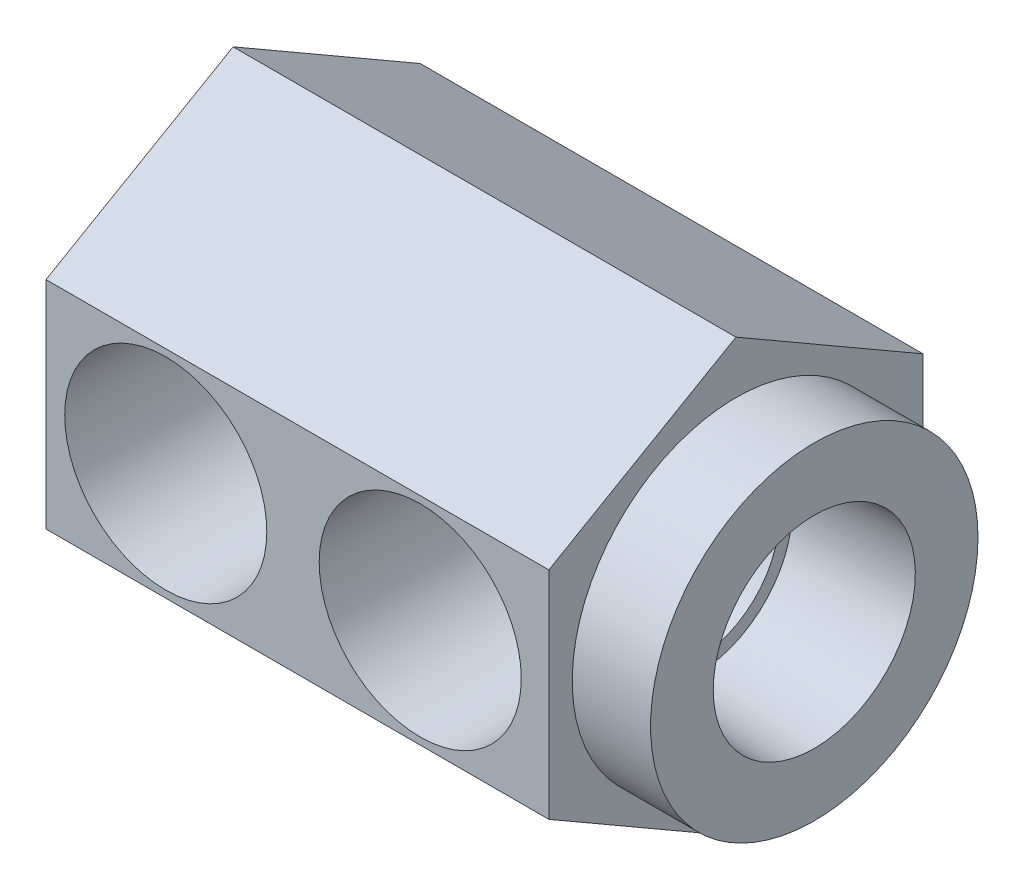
ISO-10303-21;
HEADER;
FILE_DESCRIPTION(('STEP AP214'),'2;1');
FILE_NAME('part.step','',(''),(''),'','','');
FILE_SCHEMA(('AUTOMOTIVE_DESIGN { 1 0 10303 214 1 1 1 1 }'));
ENDSEC;
DATA;
#1=APPLICATION_CONTEXT('core data for automotive mechanical design processes');
#2=APPLICATION_PROTOCOL_DEFINITION('international standard','automotive_design',2000,#1);
#3=PRODUCT_CONTEXT('',#1,'mechanical');
#4=PRODUCT('Part','Part','',(#3));
#5=PRODUCT_RELATED_PRODUCT_CATEGORY('part','',(#4));
#6=PRODUCT_DEFINITION_FORMATION('','',#4);
#7=PRODUCT_DEFINITION_CONTEXT('part definition',#1,'design');
#8=PRODUCT_DEFINITION('design','',#6,#7);
#9=PRODUCT_DEFINITION_SHAPE('','',#8);
#10=(LENGTH_UNIT() NAMED_UNIT(*) SI_UNIT(.MILLI.,.METRE.));
#11=(NAMED_UNIT(*) PLANE_ANGLE_UNIT() SI_UNIT($,.RADIAN.));
#12=(NAMED_UNIT(*) SI_UNIT($,.STERADIAN.) SOLID_ANGLE_UNIT());
#13=UNCERTAINTY_MEASURE_WITH_UNIT(LENGTH_MEASURE(1.E-05),#10,'distance_accuracy_value','');
#14=(GEOMETRIC_REPRESENTATION_CONTEXT(3) GLOBAL_UNCERTAINTY_ASSIGNED_CONTEXT((#13)) GLOBAL_UNIT_ASSIGNED_CONTEXT((#10,
#11,#12)) REPRESENTATION_CONTEXT('',''));
#15=CARTESIAN_POINT('',(0.,0.,0.));
#16=DIRECTION('',(0.,0.,1.));
#17=DIRECTION('',(1.,0.,0.));
#18=AXIS2_PLACEMENT_3D('',#15,#16,#17);
#19=CARTESIAN_POINT('',(30.9626,0.,2.6797));
#20=DIRECTION('',(0.,0.,-1.));
#21=DIRECTION('',(-1.,0.,0.));
#22=AXIS2_PLACEMENT_3D('',#19,#20,#21);
#23=PLANE('',#22);
#24=CARTESIAN_POINT('',(25.4,0.,2.6797));
#25=DIRECTION('',(0.,0.,1.));
#26=DIRECTION('',(1.,0.,0.));
#27=AXIS2_PLACEMENT_3D('',#24,#25,#26);
#28=CIRCLE('',#27,6.55797879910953);
#29=CARTESIAN_POINT('',(29.92247,4.74914213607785,2.6797));
#30=VERTEX_POINT('',#29);
#31=CARTESIAN_POINT('',(19.0669712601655,1.7028895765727,2.6797));
#32=VERTEX_POINT('',#31);
#33=EDGE_CURVE('E184',#30,#32,#28,.T.);
#34=ORIENTED_EDGE('',*,*,#33,.T.);
#35=DIRECTION('',(1.,0.,0.));
#36=VECTOR('',#35,1.);
#37=CARTESIAN_POINT('',(39.44747,1.7028895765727,2.6797));
#38=LINE('',#37,#36);
#39=CARTESIAN_POINT('',(20.1044654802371,1.7028895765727,2.6797));
#40=VERTEX_POINT('',#39);
#41=EDGE_CURVE('E64',#32,#40,#38,.T.);
#42=ORIENTED_EDGE('',*,*,#41,.T.);
#43=CARTESIAN_POINT('',(25.4,0.,2.6797));
#44=DIRECTION('',(0.,0.,1.));
#45=DIRECTION('',(1.,0.,0.));
#46=AXIS2_PLACEMENT_3D('',#43,#44,#45);
#47=CIRCLE('',#46,5.56260000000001);
#48=CARTESIAN_POINT('',(29.92247,3.23879358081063,2.6797));
#49=VERTEX_POINT('',#48);
#50=EDGE_CURVE('E192',#49,#40,#47,.T.);
#51=ORIENTED_EDGE('',*,*,#50,.F.);
#52=DIRECTION('',(0.,1.,0.));
#53=VECTOR('',#52,1.);
#54=CARTESIAN_POINT('',(29.92247,0.,2.6797));
#55=LINE('',#54,#53);
#56=EDGE_CURVE('E332',#49,#30,#55,.T.);
#57=ORIENTED_EDGE('',*,*,#56,.T.);
#58=EDGE_LOOP('',(#34,#42,#51,#57));
#59=FACE_BOUND('',#58,.T.);
#60=ADVANCED_FACE('F35',(#59),#23,.F.);
#61=CARTESIAN_POINT('',(39.44747,0.,0.));
#62=DIRECTION('',(1.,0.,0.));
#63=DIRECTION('',(0.,0.,-1.));
#64=AXIS2_PLACEMENT_3D('',#61,#62,#63);
#65=PLANE('',#64);
#66=CARTESIAN_POINT('',(39.44747,0.,0.));
#67=DIRECTION('',(1.,0.,0.));
#68=DIRECTION('',(0.,0.,-1.));
#69=AXIS2_PLACEMENT_3D('',#66,#67,#68);
#70=CIRCLE('',#69,11.1125);
#71=CARTESIAN_POINT('',(39.44747,0.,-11.1125));
#72=VERTEX_POINT('',#71);
#73=EDGE_CURVE('E283',#72,#72,#70,.T.);
#74=ORIENTED_EDGE('',*,*,#73,.T.);
#75=EDGE_LOOP('',(#74));
#76=FACE_BOUND('',#75,.T.);
#77=CARTESIAN_POINT('',(39.44747,0.,0.));
#78=DIRECTION('',(-1.,0.,0.));
#79=DIRECTION('',(0.,0.,1.));
#80=AXIS2_PLACEMENT_3D('',#77,#78,#79);
#81=CIRCLE('',#80,6.85927);
#82=CARTESIAN_POINT('',(39.44747,0.,6.85927));
#83=VERTEX_POINT('',#82);
#84=EDGE_CURVE('E279',#83,#83,#81,.T.);
#85=ORIENTED_EDGE('',*,*,#84,.T.);
#86=EDGE_LOOP('',(#85));
#87=FACE_BOUND('',#86,.T.);
#88=ADVANCED_FACE('F490',(#76,#87),#65,.T.);
#89=CARTESIAN_POINT('',(34.13125,-7.33234841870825,12.7));
#90=DIRECTION('',(1.,0.,0.));
#91=DIRECTION('',(0.,0.,-1.));
#92=AXIS2_PLACEMENT_3D('',#89,#90,#91);
#93=PLANE('',#92);
#94=DIRECTION('',(0.,-1.,0.));
#95=VECTOR('',#94,1.);
#96=CARTESIAN_POINT('',(34.13125,7.33234841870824,12.7));
#97=LINE('',#96,#95);
#98=CARTESIAN_POINT('',(34.13125,7.33234841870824,12.7));
#99=VERTEX_POINT('',#98);
#100=CARTESIAN_POINT('',(34.13125,-7.33234841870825,12.7));
#101=VERTEX_POINT('',#100);
#102=EDGE_CURVE('E289',#99,#101,#97,.T.);
#103=ORIENTED_EDGE('',*,*,#102,.T.);
#104=DIRECTION('',(0.,-0.5,-0.866025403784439));
#105=VECTOR('',#104,1.);
#106=CARTESIAN_POINT('',(34.13125,-7.33234841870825,12.7));
#107=LINE('',#106,#105);
#108=CARTESIAN_POINT('',(34.13125,-14.6646968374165,0.));
#109=VERTEX_POINT('',#108);
#110=EDGE_CURVE('E292',#101,#109,#107,.T.);
#111=ORIENTED_EDGE('',*,*,#110,.T.);
#112=DIRECTION('',(0.,0.500000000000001,-0.866025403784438));
#113=VECTOR('',#112,1.);
#114=CARTESIAN_POINT('',(34.13125,-14.6646968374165,0.));
#115=LINE('',#114,#113);
#116=CARTESIAN_POINT('',(34.13125,-7.33234841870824,-12.7));
#117=VERTEX_POINT('',#116);
#118=EDGE_CURVE('E295',#109,#117,#115,.T.);
#119=ORIENTED_EDGE('',*,*,#118,.T.);
#120=DIRECTION('',(0.,1.,0.));
#121=VECTOR('',#120,1.);
#122=CARTESIAN_POINT('',(34.13125,-7.33234841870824,-12.7));
#123=LINE('',#122,#121);
#124=CARTESIAN_POINT('',(34.13125,7.33234841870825,-12.7));
#125=VERTEX_POINT('',#124);
#126=EDGE_CURVE('E297',#117,#125,#123,.T.);
#127=ORIENTED_EDGE('',*,*,#126,.T.);
#128=DIRECTION('',(0.,0.5,0.866025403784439));
#129=VECTOR('',#128,1.);
#130=CARTESIAN_POINT('',(34.13125,7.33234841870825,-12.7));
#131=LINE('',#130,#129);
#132=CARTESIAN_POINT('',(34.13125,14.6646968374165,0.));
#133=VERTEX_POINT('',#132);
#134=EDGE_CURVE('E299',#125,#133,#131,.T.);
#135=ORIENTED_EDGE('',*,*,#134,.T.);
#136=DIRECTION('',(0.,-0.5,0.866025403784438));
#137=VECTOR('',#136,1.);
#138=CARTESIAN_POINT('',(34.13125,14.6646968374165,0.));
#139=LINE('',#138,#137);
#140=EDGE_CURVE('E301',#133,#99,#139,.T.);
#141=ORIENTED_EDGE('',*,*,#140,.T.);
#142=EDGE_LOOP('',(#103,#111,#119,#127,#135,#141));
#143=FACE_BOUND('',#142,.T.);
#144=CARTESIAN_POINT('',(34.13125,0.,0.));
#145=DIRECTION('',(1.,0.,0.));
#146=DIRECTION('',(0.,0.,-1.));
#147=AXIS2_PLACEMENT_3D('',#144,#145,#146);
#148=CIRCLE('',#147,11.1125);
#149=CARTESIAN_POINT('',(34.13125,0.,-11.1125));
#150=VERTEX_POINT('',#149);
#151=EDGE_CURVE('E282',#150,#150,#148,.T.);
#152=ORIENTED_EDGE('',*,*,#151,.F.);
#153=EDGE_LOOP('',(#152));
#154=FACE_BOUND('',#153,.T.);
#155=ADVANCED_FACE('F449',(#143,#154),#93,.T.);
#156=CARTESIAN_POINT('',(34.13125,7.33234841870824,12.7));
#157=DIRECTION('',(0.,0.,-1.));
#158=DIRECTION('',(0.,1.,0.));
#159=AXIS2_PLACEMENT_3D('',#156,#157,#158);
#160=PLANE('',#159);
#161=CARTESIAN_POINT('',(8.128,0.,12.7));
#162=DIRECTION('',(0.,0.,1.));
#163=DIRECTION('',(1.,0.,0.));
#164=AXIS2_PLACEMENT_3D('',#161,#162,#163);
#165=CIRCLE('',#164,6.858);
#166=CARTESIAN_POINT('',(14.986,0.,12.7));
#167=VERTEX_POINT('',#166);
#168=EDGE_CURVE('E422',#167,#167,#165,.T.);
#169=ORIENTED_EDGE('',*,*,#168,.F.);
#170=EDGE_LOOP('',(#169));
#171=FACE_BOUND('',#170,.T.);
#172=CARTESIAN_POINT('',(25.4,0.,12.7));
#173=DIRECTION('',(0.,0.,1.));
#174=DIRECTION('',(1.,0.,0.));
#175=AXIS2_PLACEMENT_3D('',#172,#173,#174);
#176=CIRCLE('',#175,6.858);
#177=CARTESIAN_POINT('',(32.258,0.,12.7));
#178=VERTEX_POINT('',#177);
#179=EDGE_CURVE('E185',#178,#178,#176,.T.);
#180=ORIENTED_EDGE('',*,*,#179,.F.);
#181=EDGE_LOOP('',(#180));
#182=FACE_BOUND('',#181,.T.);
#183=DIRECTION('',(0.,-1.,0.));
#184=VECTOR('',#183,1.);
#185=CARTESIAN_POINT('',(0.,7.33234841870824,12.7));
#186=LINE('',#185,#184);
#187=CARTESIAN_POINT('',(0.,7.33234841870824,12.7));
#188=VERTEX_POINT('',#187);
#189=CARTESIAN_POINT('',(0.,-7.33234841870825,12.7));
#190=VERTEX_POINT('',#189);
#191=EDGE_CURVE('E286',#188,#190,#186,.T.);
#192=ORIENTED_EDGE('',*,*,#191,.T.);
#193=DIRECTION('',(-1.,0.,0.));
#194=VECTOR('',#193,1.);
#195=CARTESIAN_POINT('',(34.13125,-7.33234841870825,12.7));
#196=LINE('',#195,#194);
#197=EDGE_CURVE('E328',#101,#190,#196,.T.);
#198=ORIENTED_EDGE('',*,*,#197,.F.);
#199=ORIENTED_EDGE('',*,*,#102,.F.);
#200=DIRECTION('',(-1.,0.,0.));
#201=VECTOR('',#200,1.);
#202=CARTESIAN_POINT('',(34.13125,7.33234841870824,12.7));
#203=LINE('',#202,#201);
#204=EDGE_CURVE('E303',#99,#188,#203,.T.);
#205=ORIENTED_EDGE('',*,*,#204,.T.);
#206=EDGE_LOOP('',(#192,#198,#199,#205));
#207=FACE_BOUND('',#206,.T.);
#208=ADVANCED_FACE('F37',(#171,#182,#207),#160,.F.);
#209=CARTESIAN_POINT('',(34.13125,-7.33234841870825,12.7));
#210=DIRECTION('',(0.,0.866025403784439,-0.5));
#211=DIRECTION('',(0.,0.5,0.866025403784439));
#212=AXIS2_PLACEMENT_3D('',#209,#210,#211);
#213=PLANE('',#212);
#214=DIRECTION('',(0.,-0.5,-0.866025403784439));
#215=VECTOR('',#214,1.);
#216=CARTESIAN_POINT('',(0.,-7.33234841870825,12.7));
#217=LINE('',#216,#215);
#218=CARTESIAN_POINT('',(0.,-14.6646968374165,0.));
#219=VERTEX_POINT('',#218);
#220=EDGE_CURVE('E306',#190,#219,#217,.T.);
#221=ORIENTED_EDGE('',*,*,#220,.T.);
#222=DIRECTION('',(-1.,0.,0.));
#223=VECTOR('',#222,1.);
#224=CARTESIAN_POINT('',(34.13125,-14.6646968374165,0.));
#225=LINE('',#224,#223);
#226=EDGE_CURVE('E326',#109,#219,#225,.T.);
#227=ORIENTED_EDGE('',*,*,#226,.F.);
#228=ORIENTED_EDGE('',*,*,#110,.F.);
#229=ORIENTED_EDGE('',*,*,#197,.T.);
#230=EDGE_LOOP('',(#221,#227,#228,#229));
#231=FACE_BOUND('',#230,.T.);
#232=ADVANCED_FACE('F448',(#231),#213,.F.);
#233=CARTESIAN_POINT('',(34.13125,-14.6646968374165,0.));
#234=DIRECTION('',(0.,0.866025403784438,0.500000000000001));
#235=DIRECTION('',(0.,-0.500000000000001,0.866025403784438));
#236=AXIS2_PLACEMENT_3D('',#233,#234,#235);
#237=PLANE('',#236);
#238=DIRECTION('',(0.,0.500000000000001,-0.866025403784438));
#239=VECTOR('',#238,1.);
#240=CARTESIAN_POINT('',(0.,-14.6646968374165,0.));
#241=LINE('',#240,#239);
#242=CARTESIAN_POINT('',(0.,-7.33234841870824,-12.7));
#243=VERTEX_POINT('',#242);
#244=EDGE_CURVE('E308',#219,#243,#241,.T.);
#245=ORIENTED_EDGE('',*,*,#244,.T.);
#246=DIRECTION('',(-1.,0.,0.));
#247=VECTOR('',#246,1.);
#248=CARTESIAN_POINT('',(34.13125,-7.33234841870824,-12.7));
#249=LINE('',#248,#247);
#250=EDGE_CURVE('E323',#117,#243,#249,.T.);
#251=ORIENTED_EDGE('',*,*,#250,.F.);
#252=ORIENTED_EDGE('',*,*,#118,.F.);
#253=ORIENTED_EDGE('',*,*,#226,.T.);
#254=EDGE_LOOP('',(#245,#251,#252,#253));
#255=FACE_BOUND('',#254,.T.);
#256=ADVANCED_FACE('F464',(#255),#237,.F.);
#257=CARTESIAN_POINT('',(34.13125,-7.33234841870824,-12.7));
#258=DIRECTION('',(0.,0.,1.));
#259=DIRECTION('',(0.,-1.,0.));
#260=AXIS2_PLACEMENT_3D('',#257,#258,#259);
#261=PLANE('',#260);
#262=CARTESIAN_POINT('',(8.128,0.,-12.7));
#263=DIRECTION('',(0.,0.,-1.));
#264=DIRECTION('',(0.,1.,0.));
#265=AXIS2_PLACEMENT_3D('',#262,#263,#264);
#266=CIRCLE('',#265,6.858);
#267=CARTESIAN_POINT('',(8.128,6.858,-12.7));
#268=VERTEX_POINT('',#267);
#269=EDGE_CURVE('E261',#268,#268,#266,.T.);
#270=ORIENTED_EDGE('',*,*,#269,.F.);
#271=EDGE_LOOP('',(#270));
#272=FACE_BOUND('',#271,.T.);
#273=DIRECTION('',(0.,1.,0.));
#274=VECTOR('',#273,1.);
#275=CARTESIAN_POINT('',(0.,-7.33234841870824,-12.7));
#276=LINE('',#275,#274);
#277=CARTESIAN_POINT('',(0.,7.33234841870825,-12.7));
#278=VERTEX_POINT('',#277);
#279=EDGE_CURVE('E310',#243,#278,#276,.T.);
#280=ORIENTED_EDGE('',*,*,#279,.T.);
#281=DIRECTION('',(-1.,0.,0.));
#282=VECTOR('',#281,1.);
#283=CARTESIAN_POINT('',(34.13125,7.33234841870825,-12.7));
#284=LINE('',#283,#282);
#285=EDGE_CURVE('E320',#125,#278,#284,.T.);
#286=ORIENTED_EDGE('',*,*,#285,.F.);
#287=ORIENTED_EDGE('',*,*,#126,.F.);
#288=ORIENTED_EDGE('',*,*,#250,.T.);
#289=EDGE_LOOP('',(#280,#286,#287,#288));
#290=FACE_BOUND('',#289,.T.);
#291=ADVANCED_FACE('F478',(#272,#290),#261,.F.);
#292=CARTESIAN_POINT('',(34.13125,7.33234841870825,-12.7));
#293=DIRECTION('',(0.,-0.866025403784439,0.5));
#294=DIRECTION('',(0.,-0.5,-0.866025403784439));
#295=AXIS2_PLACEMENT_3D('',#292,#293,#294);
#296=PLANE('',#295);
#297=DIRECTION('',(0.,0.5,0.866025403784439));
#298=VECTOR('',#297,1.);
#299=CARTESIAN_POINT('',(0.,7.33234841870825,-12.7));
#300=LINE('',#299,#298);
#301=CARTESIAN_POINT('',(0.,14.6646968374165,0.));
#302=VERTEX_POINT('',#301);
#303=EDGE_CURVE('E312',#278,#302,#300,.T.);
#304=ORIENTED_EDGE('',*,*,#303,.T.);
#305=DIRECTION('',(-1.,0.,0.));
#306=VECTOR('',#305,1.);
#307=CARTESIAN_POINT('',(34.13125,14.6646968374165,0.));
#308=LINE('',#307,#306);
#309=EDGE_CURVE('E317',#133,#302,#308,.T.);
#310=ORIENTED_EDGE('',*,*,#309,.F.);
#311=ORIENTED_EDGE('',*,*,#134,.F.);
#312=ORIENTED_EDGE('',*,*,#285,.T.);
#313=EDGE_LOOP('',(#304,#310,#311,#312));
#314=FACE_BOUND('',#313,.T.);
#315=ADVANCED_FACE('F476',(#314),#296,.F.);
#316=CARTESIAN_POINT('',(34.13125,14.6646968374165,0.));
#317=DIRECTION('',(0.,-0.866025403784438,-0.5));
#318=DIRECTION('',(0.,0.5,-0.866025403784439));
#319=AXIS2_PLACEMENT_3D('',#316,#317,#318);
#320=PLANE('',#319);
#321=DIRECTION('',(0.,-0.5,0.866025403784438));
#322=VECTOR('',#321,1.);
#323=CARTESIAN_POINT('',(0.,14.6646968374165,0.));
#324=LINE('',#323,#322);
#325=EDGE_CURVE('E293',#302,#188,#324,.T.);
#326=ORIENTED_EDGE('',*,*,#325,.T.);
#327=ORIENTED_EDGE('',*,*,#204,.F.);
#328=ORIENTED_EDGE('',*,*,#140,.F.);
#329=ORIENTED_EDGE('',*,*,#309,.T.);
#330=EDGE_LOOP('',(#326,#327,#328,#329));
#331=FACE_BOUND('',#330,.T.);
#332=ADVANCED_FACE('F474',(#331),#320,.F.);
#333=CARTESIAN_POINT('',(0.,-7.33234841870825,12.7));
#334=DIRECTION('',(1.,0.,0.));
#335=DIRECTION('',(0.,0.,-1.));
#336=AXIS2_PLACEMENT_3D('',#333,#334,#335);
#337=PLANE('',#336);
#338=ORIENTED_EDGE('',*,*,#191,.F.);
#339=ORIENTED_EDGE('',*,*,#325,.F.);
#340=ORIENTED_EDGE('',*,*,#303,.F.);
#341=ORIENTED_EDGE('',*,*,#279,.F.);
#342=ORIENTED_EDGE('',*,*,#244,.F.);
#343=ORIENTED_EDGE('',*,*,#220,.F.);
#344=EDGE_LOOP('',(#338,#339,#340,#341,#342,#343));
#345=FACE_BOUND('',#344,.T.);
#346=ADVANCED_FACE('F457',(#345),#337,.F.);
#347=CARTESIAN_POINT('',(39.44747,0.,0.));
#348=DIRECTION('',(-1.,0.,0.));
#349=DIRECTION('',(0.,0.,1.));
#350=AXIS2_PLACEMENT_3D('',#347,#348,#349);
#351=CYLINDRICAL_SURFACE('',#350,11.1125);
#352=ORIENTED_EDGE('',*,*,#73,.F.);
#353=EDGE_LOOP('',(#352));
#354=FACE_BOUND('',#353,.T.);
#355=ORIENTED_EDGE('',*,*,#151,.T.);
#356=EDGE_LOOP('',(#355));
#357=FACE_BOUND('',#356,.T.);
#358=ADVANCED_FACE('F519',(#354,#357),#351,.T.);
#359=CARTESIAN_POINT('',(39.44747,0.,0.));
#360=DIRECTION('',(1.,0.,0.));
#361=DIRECTION('',(0.,0.,-1.));
#362=AXIS2_PLACEMENT_3D('',#359,#360,#361);
#363=CONICAL_SURFACE('',#362,6.85927,0.0523598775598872);
#364=CARTESIAN_POINT('',(31.434967,2.79651950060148,5.80040855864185));
#365=CARTESIAN_POINT('',(31.4885738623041,2.68491125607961,5.85734580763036));
#366=CARTESIAN_POINT('',(31.5395481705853,2.57051306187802,5.9113986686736));
#367=CARTESIAN_POINT('',(31.6356400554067,2.33643131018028,6.01316652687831));
#368=CARTESIAN_POINT('',(31.6807526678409,2.21674338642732,6.06087615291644));
#369=CARTESIAN_POINT('',(31.7646308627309,1.97200075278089,6.14949518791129));
#370=CARTESIAN_POINT('',(31.8033661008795,1.84692376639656,6.19037209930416));
#371=CARTESIAN_POINT('',(31.8736020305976,1.59255780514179,6.2644343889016));
#372=CARTESIAN_POINT('',(31.9051046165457,1.46326994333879,6.29762178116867));
#373=CARTESIAN_POINT('',(31.9604703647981,1.20051379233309,6.35591633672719));
#374=CARTESIAN_POINT('',(31.9842919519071,1.06702690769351,6.380979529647));
#375=CARTESIAN_POINT('',(32.0235910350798,0.797488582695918,6.42231247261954));
#376=CARTESIAN_POINT('',(32.0390691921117,0.661437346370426,6.43858291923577));
#377=CARTESIAN_POINT('',(32.0613239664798,0.388244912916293,6.46197333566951));
#378=CARTESIAN_POINT('',(32.0681260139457,0.25110809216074,6.46912004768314));
#379=CARTESIAN_POINT('',(32.0729626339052,-0.0234825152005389,6.47420197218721));
#380=CARTESIAN_POINT('',(32.0709980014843,-0.160936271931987,6.47213802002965));
#381=CARTESIAN_POINT('',(32.058806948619,-0.425053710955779,6.45932755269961));
#382=CARTESIAN_POINT('',(32.0491894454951,-0.551777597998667,6.44922096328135));
#383=CARTESIAN_POINT('',(32.0226279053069,-0.80364039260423,6.42129811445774));
#384=CARTESIAN_POINT('',(32.005681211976,-0.928778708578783,6.40347905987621));
#385=CARTESIAN_POINT('',(31.964723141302,-1.17682126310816,6.36038910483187));
#386=CARTESIAN_POINT('',(31.9406993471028,-1.29972116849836,6.33510510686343));
#387=CARTESIAN_POINT('',(31.8860008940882,-1.54235323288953,6.27749566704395));
#388=CARTESIAN_POINT('',(31.8553245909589,-1.66208460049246,6.24516848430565));
#389=CARTESIAN_POINT('',(31.7700806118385,-1.95951809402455,6.15525600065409));
#390=CARTESIAN_POINT('',(31.7114113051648,-2.13476678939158,6.09330594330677));
#391=CARTESIAN_POINT('',(31.6141871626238,-2.38938982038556,5.9904492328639));
#392=CARTESIAN_POINT('',(31.5803287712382,-2.47271111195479,5.95460001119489));
#393=CARTESIAN_POINT('',(31.5097463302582,-2.63664903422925,5.87978975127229));
#394=CARTESIAN_POINT('',(31.4730236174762,-2.71726690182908,5.84083016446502));
#395=CARTESIAN_POINT('',(31.434967,-2.79651950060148,5.80040855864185));
#396=B_SPLINE_CURVE_WITH_KNOTS('',3,(#364,#365,#366,#367,#368,#369,#370,#371,#372,#373,#374,
#375,#376,#377,#378,#379,#380,#381,#382,#383,#384,#385,#386,#387,#388,#389,#390,#391,#392,#393,
#394,#395),.UNSPECIFIED.,.F.,.F.,(4,2,2,2,2,2,2,2,2,2,2,2,2,2,2,4),(0.,0.408818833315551,
0.817981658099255,1.22903833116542,1.6399872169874,2.05312450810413,2.46622906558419,
2.87811998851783,3.28997355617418,3.6719864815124,4.05413797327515,4.43696398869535,
4.81988473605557,5.4031989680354,5.69355402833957,5.98377437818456),.UNSPECIFIED.);
#397=CARTESIAN_POINT('',(31.50997,2.63463996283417,5.88001456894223));
#398=VERTEX_POINT('',#397);
#399=CARTESIAN_POINT('',(31.50997,-2.63463996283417,5.88001456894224));
#400=VERTEX_POINT('',#399);
#401=EDGE_CURVE('E242',#398,#400,#396,.T.);
#402=ORIENTED_EDGE('',*,*,#401,.F.);
#403=CARTESIAN_POINT('',(31.50997,0.,0.));
#404=DIRECTION('',(-1.,0.,0.));
#405=DIRECTION('',(0.,0.,1.));
#406=AXIS2_PLACEMENT_3D('',#403,#404,#405);
#407=CIRCLE('',#406,6.4432832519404);
#408=EDGE_CURVE('E276',#398,#400,#407,.T.);
#409=ORIENTED_EDGE('',*,*,#408,.T.);
#410=EDGE_LOOP('',(#402,#409));
#411=FACE_BOUND('',#410,.T.);
#412=ORIENTED_EDGE('',*,*,#84,.F.);
#413=EDGE_LOOP('',(#412));
#414=FACE_BOUND('',#413,.T.);
#415=ADVANCED_FACE('F516',(#411,#414),#363,.F.);
#416=CARTESIAN_POINT('',(31.50997,0.,-5.55625));
#417=DIRECTION('',(1.,0.,0.));
#418=DIRECTION('',(0.,0.,-1.));
#419=AXIS2_PLACEMENT_3D('',#416,#417,#418);
#420=PLANE('',#419);
#421=CARTESIAN_POINT('',(31.50997,-3.40485172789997,17.2630170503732));
#422=CARTESIAN_POINT('',(31.50997,-3.33912103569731,16.1949703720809));
#423=CARTESIAN_POINT('',(31.50997,-3.27201398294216,15.127006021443));
#424=CARTESIAN_POINT('',(31.50997,-3.13431515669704,12.991328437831));
#425=CARTESIAN_POINT('',(31.50997,-3.06372346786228,11.923615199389));
#426=CARTESIAN_POINT('',(31.50997,-2.91834199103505,9.78879369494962));
#427=CARTESIAN_POINT('',(31.50997,-2.84355346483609,8.72168534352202));
#428=CARTESIAN_POINT('',(31.50997,-2.68864021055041,6.58782277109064));
#429=CARTESIAN_POINT('',(31.50997,-2.60851532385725,5.52106856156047));
#430=CARTESIAN_POINT('',(31.50997,-2.44128073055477,3.3876946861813));
#431=CARTESIAN_POINT('',(31.50997,-2.35416839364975,2.32107522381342));
#432=CARTESIAN_POINT('',(31.50997,-2.21624588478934,0.721810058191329));
#433=CARTESIAN_POINT('',(31.50997,-2.16906454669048,0.188851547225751));
#434=CARTESIAN_POINT('',(31.50997,-2.07174805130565,-0.87680396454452));
#435=CARTESIAN_POINT('',(31.50997,-2.02161285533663,-1.40950096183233));
#436=CARTESIAN_POINT('',(31.50997,-1.91766350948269,-2.47471868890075));
#437=CARTESIAN_POINT('',(31.50997,-1.863848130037,-3.00723929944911));
#438=CARTESIAN_POINT('',(31.50997,-1.75150147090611,-4.07176620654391));
#439=CARTESIAN_POINT('',(31.50997,-1.69297035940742,-4.60377252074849));
#440=CARTESIAN_POINT('',(31.50997,-1.569551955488,-5.66718749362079));
#441=CARTESIAN_POINT('',(31.50997,-1.50466316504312,-6.19859598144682));
#442=CARTESIAN_POINT('',(31.50997,-1.40040042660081,-6.99483769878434));
#443=CARTESIAN_POINT('',(31.50997,-1.36448891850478,-7.26012215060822));
#444=CARTESIAN_POINT('',(31.50997,-1.28967950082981,-7.79027968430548));
#445=CARTESIAN_POINT('',(31.50997,-1.25078146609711,-8.05515274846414));
#446=CARTESIAN_POINT('',(31.50997,-1.21005294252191,-8.31975375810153));
#447=B_SPLINE_CURVE_WITH_KNOTS('',3,(#421,#422,#423,#424,#425,#426,#427,#428,#429,#430,#431,
#432,#433,#434,#435,#436,#437,#438,#439,#440,#441,#442,#443,#444,#445,#446),.UNSPECIFIED.,.F.,
.F.,(4,2,2,2,2,2,2,2,2,2,2,2,4),(0.,3.21020479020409,6.42033163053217,9.62949845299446,
12.8387607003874,16.0492367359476,17.654358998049,19.2595022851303,20.8651845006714,
22.470809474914,24.0768136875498,24.8799111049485,25.6830421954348),.UNSPECIFIED.);
#448=CARTESIAN_POINT('',(31.50997,-2.56197927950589,4.93033226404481));
#449=VERTEX_POINT('',#448);
#450=EDGE_CURVE('E249',#400,#449,#447,.T.);
#451=ORIENTED_EDGE('',*,*,#450,.F.);
#452=ORIENTED_EDGE('',*,*,#408,.F.);
#453=CARTESIAN_POINT('',(31.50997,1.21005294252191,-8.31975375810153));
#454=CARTESIAN_POINT('',(31.50997,1.25078146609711,-8.05515274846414));
#455=CARTESIAN_POINT('',(31.50997,1.28967950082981,-7.79027968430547));
#456=CARTESIAN_POINT('',(31.50997,1.36448891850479,-7.26012215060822));
#457=CARTESIAN_POINT('',(31.50997,1.40040042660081,-6.99483769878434));
#458=CARTESIAN_POINT('',(31.50997,1.50466316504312,-6.19859598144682));
#459=CARTESIAN_POINT('',(31.50997,1.569551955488,-5.6671874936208));
#460=CARTESIAN_POINT('',(31.50997,1.69297035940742,-4.60377252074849));
#461=CARTESIAN_POINT('',(31.50997,1.75150147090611,-4.07176620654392));
#462=CARTESIAN_POINT('',(31.50997,1.863848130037,-3.00723929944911));
#463=CARTESIAN_POINT('',(31.50997,1.91766350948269,-2.47471868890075));
#464=CARTESIAN_POINT('',(31.50997,2.02161285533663,-1.40950096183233));
#465=CARTESIAN_POINT('',(31.50997,2.07174805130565,-0.87680396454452));
#466=CARTESIAN_POINT('',(31.50997,2.16906454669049,0.188851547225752));
#467=CARTESIAN_POINT('',(31.50997,2.21624588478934,0.721810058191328));
#468=CARTESIAN_POINT('',(31.50997,2.35416839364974,2.32107522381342));
#469=CARTESIAN_POINT('',(31.50997,2.44128073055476,3.3876946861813));
#470=CARTESIAN_POINT('',(31.50997,2.60851532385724,5.52106856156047));
#471=CARTESIAN_POINT('',(31.50997,2.6886402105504,6.58782277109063));
#472=CARTESIAN_POINT('',(31.50997,2.8435534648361,8.72168534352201));
#473=CARTESIAN_POINT('',(31.50997,2.91834199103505,9.78879369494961));
#474=CARTESIAN_POINT('',(31.50997,3.06372346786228,11.923615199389));
#475=CARTESIAN_POINT('',(31.50997,3.13431515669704,12.991328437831));
#476=CARTESIAN_POINT('',(31.50997,3.27201398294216,15.127006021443));
#477=CARTESIAN_POINT('',(31.50997,3.33912103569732,16.1949703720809));
#478=CARTESIAN_POINT('',(31.50997,3.40485172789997,17.2630170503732));
#479=B_SPLINE_CURVE_WITH_KNOTS('',3,(#453,#454,#455,#456,#457,#458,#459,#460,#461,#462,#463,
#464,#465,#466,#467,#468,#469,#470,#471,#472,#473,#474,#475,#476,#477,#478),.UNSPECIFIED.,.F.,
.F.,(4,2,2,2,2,2,2,2,2,2,2,2,4),(0.,0.80313109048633,1.606228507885,3.21223272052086,
4.81785769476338,6.42353991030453,8.02868319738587,9.63380545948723,12.8442814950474,
16.0535437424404,19.2627105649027,22.4728374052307,25.6830421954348),.UNSPECIFIED.);
#480=CARTESIAN_POINT('',(31.50997,2.5619792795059,4.93033226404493));
#481=VERTEX_POINT('',#480);
#482=EDGE_CURVE('E205',#481,#398,#479,.T.);
#483=ORIENTED_EDGE('',*,*,#482,.F.);
#484=CARTESIAN_POINT('',(31.50997,0.,0.));
#485=DIRECTION('',(-1.,0.,0.));
#486=DIRECTION('',(0.,0.,1.));
#487=AXIS2_PLACEMENT_3D('',#484,#485,#486);
#488=CIRCLE('',#487,5.55625);
#489=EDGE_CURVE('E273',#481,#449,#488,.T.);
#490=ORIENTED_EDGE('',*,*,#489,.T.);
#491=EDGE_LOOP('',(#451,#452,#483,#490));
#492=FACE_BOUND('',#491,.T.);
#493=ADVANCED_FACE('F514',(#492),#420,.T.);
#494=CARTESIAN_POINT('',(-12.2161702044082,0.,0.));
#495=DIRECTION('',(-1.,0.,0.));
#496=DIRECTION('',(0.,0.,1.));
#497=AXIS2_PLACEMENT_3D('',#494,#495,#496);
#498=CYLINDRICAL_SURFACE('',#497,5.55625);
#499=CARTESIAN_POINT('',(31.51017,-2.56152070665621,4.93057052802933));
#500=CARTESIAN_POINT('',(31.4436665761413,-2.71404523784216,4.85132005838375));
#501=CARTESIAN_POINT('',(31.3724271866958,-2.86113407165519,4.76593043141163));
#502=CARTESIAN_POINT('',(31.222298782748,-3.14398924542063,4.58426476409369));
#503=CARTESIAN_POINT('',(31.1434194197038,-3.27976947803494,4.48800243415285));
#504=CARTESIAN_POINT('',(30.9812552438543,-3.53740196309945,4.28775051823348));
#505=CARTESIAN_POINT('',(30.8980863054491,-3.65947415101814,4.18394817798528));
#506=CARTESIAN_POINT('',(30.7275112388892,-3.89267876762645,3.96790084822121));
#507=CARTESIAN_POINT('',(30.6401046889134,-4.00381010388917,3.85565501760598));
#508=CARTESIAN_POINT('',(30.4490304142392,-4.23131634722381,3.60564002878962));
#509=CARTESIAN_POINT('',(30.3449139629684,-4.34591093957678,3.46658760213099));
#510=CARTESIAN_POINT('',(30.1873089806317,-4.50762737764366,3.24983980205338));
#511=CARTESIAN_POINT('',(30.1342276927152,-4.56010743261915,3.17578133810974));
#512=CARTESIAN_POINT('',(30.0281182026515,-4.66141056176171,3.02512683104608));
#513=CARTESIAN_POINT('',(29.9750900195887,-4.71023260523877,2.94853008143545));
#514=CARTESIAN_POINT('',(29.92227,-4.75722472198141,2.87066664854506));
#515=B_SPLINE_CURVE_WITH_KNOTS('',3,(#499,#500,#501,#502,#503,#504,#505,#506,#507,#508,#509,
#510,#511,#512,#513,#514),.UNSPECIFIED.,.F.,.F.,(4,2,2,2,2,2,2,4),(0.,0.552446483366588,
1.1042039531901,1.64520405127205,2.186258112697,2.80973715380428,3.1251069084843,
3.4405651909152),.UNSPECIFIED.);
#516=CARTESIAN_POINT('',(29.92247,-4.75704677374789,2.87096152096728));
#517=VERTEX_POINT('',#516);
#518=EDGE_CURVE('E255',#449,#517,#515,.T.);
#519=ORIENTED_EDGE('',*,*,#518,.F.);
#520=ORIENTED_EDGE('',*,*,#489,.F.);
#521=CARTESIAN_POINT('',(29.92227,4.75722472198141,2.87066664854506));
#522=CARTESIAN_POINT('',(29.9714207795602,4.71349676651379,2.94312370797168));
#523=CARTESIAN_POINT('',(30.0207539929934,4.6681825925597,3.01448372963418));
#524=CARTESIAN_POINT('',(30.1195036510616,4.57437090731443,3.15502687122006));
#525=CARTESIAN_POINT('',(30.1689200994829,4.52587324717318,3.22420988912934));
#526=CARTESIAN_POINT('',(30.3169890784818,4.37546886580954,3.42868072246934));
#527=CARTESIAN_POINT('',(30.415335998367,4.26876084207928,3.56070785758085));
#528=CARTESIAN_POINT('',(30.6068647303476,4.04510991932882,3.81270550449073));
#529=CARTESIAN_POINT('',(30.7001132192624,3.92845667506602,3.93288260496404));
#530=CARTESIAN_POINT('',(30.8819101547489,3.68290806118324,4.16370822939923));
#531=CARTESIAN_POINT('',(30.970462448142,3.55402296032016,4.27436459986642));
#532=CARTESIAN_POINT('',(31.1383585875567,3.2882843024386,4.48180571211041));
#533=CARTESIAN_POINT('',(31.2179073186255,3.15182183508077,4.57892274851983));
#534=CARTESIAN_POINT('',(31.3700495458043,2.86603911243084,4.76307965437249));
#535=CARTESIAN_POINT('',(31.4425556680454,2.71659253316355,4.84999518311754));
#536=CARTESIAN_POINT('',(31.51017,2.56152070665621,4.93057052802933));
#537=B_SPLINE_CURVE_WITH_KNOTS('',3,(#521,#522,#523,#524,#525,#526,#527,#528,#529,#530,#531,
#532,#533,#534,#535,#536),.UNSPECIFIED.,.F.,.F.,(4,2,2,2,2,2,2,4),(0.,0.293558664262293,
0.587131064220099,1.17501535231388,1.74946363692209,2.32343386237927,2.87889148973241,
3.44053822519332),.UNSPECIFIED.);
#538=CARTESIAN_POINT('',(29.92247,4.7570467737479,2.87096152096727));
#539=VERTEX_POINT('',#538);
#540=EDGE_CURVE('E198',#539,#481,#537,.T.);
#541=ORIENTED_EDGE('',*,*,#540,.F.);
#542=CARTESIAN_POINT('',(29.92247,0.,0.));
#543=DIRECTION('',(-1.,0.,0.));
#544=DIRECTION('',(0.,0.,1.));
#545=AXIS2_PLACEMENT_3D('',#542,#543,#544);
#546=CIRCLE('',#545,5.55625);
#547=EDGE_CURVE('E270',#539,#517,#546,.T.);
#548=ORIENTED_EDGE('',*,*,#547,.T.);
#549=EDGE_LOOP('',(#519,#520,#541,#548));
#550=FACE_BOUND('',#549,.T.);
#551=ADVANCED_FACE('F212',(#550),#498,.F.);
#552=CARTESIAN_POINT('',(29.92247,0.,-5.55625));
#553=DIRECTION('',(1.,0.,0.));
#554=DIRECTION('',(0.,0.,-1.));
#555=AXIS2_PLACEMENT_3D('',#552,#553,#554);
#556=PLANE('',#555);
#557=CARTESIAN_POINT('',(29.92247,-5.32151301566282,16.8962242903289));
#558=CARTESIAN_POINT('',(29.92247,-5.23763190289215,14.7617339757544));
#559=CARTESIAN_POINT('',(29.92247,-5.15294049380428,12.6272752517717));
#560=CARTESIAN_POINT('',(29.92247,-4.98162940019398,8.35843768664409));
#561=CARTESIAN_POINT('',(29.92247,-4.89500971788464,6.22405884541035));
#562=CARTESIAN_POINT('',(29.92247,-4.71953417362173,1.95539211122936));
#563=CARTESIAN_POINT('',(29.92247,-4.63067831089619,-0.178895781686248));
#564=CARTESIAN_POINT('',(29.92247,-4.45028389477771,-4.44736055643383));
#565=CARTESIAN_POINT('',(29.92247,-4.35874533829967,-6.58153743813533));
#566=CARTESIAN_POINT('',(29.92247,-4.26564226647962,-8.71564669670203));
#567=B_SPLINE_CURVE_WITH_KNOTS('',3,(#557,#558,#559,#560,#561,#562,#563,#564,#565,#566),
.UNSPECIFIED.,.F.,.F.,(4,2,2,2,4),(0.,6.40841377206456,12.8168201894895,19.2252288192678,
25.633644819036),.UNSPECIFIED.);
#568=CARTESIAN_POINT('',(29.92247,-4.74914213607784,2.6797));
#569=VERTEX_POINT('',#568);
#570=EDGE_CURVE('E49',#517,#569,#567,.T.);
#571=ORIENTED_EDGE('',*,*,#570,.F.);
#572=ORIENTED_EDGE('',*,*,#547,.F.);
#573=CARTESIAN_POINT('',(29.92247,4.26564226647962,-8.71564669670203));
#574=CARTESIAN_POINT('',(29.92247,4.35874533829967,-6.58153743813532));
#575=CARTESIAN_POINT('',(29.92247,4.45028389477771,-4.44736055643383));
#576=CARTESIAN_POINT('',(29.92247,4.63067831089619,-0.178895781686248));
#577=CARTESIAN_POINT('',(29.92247,4.71953417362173,1.95539211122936));
#578=CARTESIAN_POINT('',(29.92247,4.89500971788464,6.22405884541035));
#579=CARTESIAN_POINT('',(29.92247,4.98162940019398,8.35843768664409));
#580=CARTESIAN_POINT('',(29.92247,5.15294049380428,12.6272752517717));
#581=CARTESIAN_POINT('',(29.92247,5.23763190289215,14.7617339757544));
#582=CARTESIAN_POINT('',(29.92247,5.32151301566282,16.8962242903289));
#583=B_SPLINE_CURVE_WITH_KNOTS('',3,(#573,#574,#575,#576,#577,#578,#579,#580,#581,#582),
.UNSPECIFIED.,.F.,.F.,(4,2,2,2,4),(0.,6.40841599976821,12.8168246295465,19.2252310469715,
25.633644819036),.UNSPECIFIED.);
#584=EDGE_CURVE('E225',#30,#539,#583,.T.);
#585=ORIENTED_EDGE('',*,*,#584,.F.);
#586=ORIENTED_EDGE('',*,*,#56,.F.);
#587=DIRECTION('',(0.,0.,1.));
#588=VECTOR('',#587,1.);
#589=CARTESIAN_POINT('',(29.92247,3.23879358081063,12.7));
#590=LINE('',#589,#588);
#591=CARTESIAN_POINT('',(29.92247,3.23879358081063,-4.3688));
#592=VERTEX_POINT('',#591);
#593=EDGE_CURVE('E336',#592,#49,#590,.T.);
#594=ORIENTED_EDGE('',*,*,#593,.F.);
#595=CARTESIAN_POINT('',(29.92247,-8.71602218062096,-1.81102098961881));
#596=CARTESIAN_POINT('',(29.92247,-8.50084869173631,-1.92576274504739));
#597=CARTESIAN_POINT('',(29.92247,-8.28531316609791,-2.03983259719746));
#598=CARTESIAN_POINT('',(29.92247,-7.85332975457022,-2.26626874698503));
#599=CARTESIAN_POINT('',(29.92247,-7.6368818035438,-2.37863492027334));
#600=CARTESIAN_POINT('',(29.92247,-7.20233153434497,-2.60158729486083));
#601=CARTESIAN_POINT('',(29.92247,-6.98422632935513,-2.71216788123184));
#602=CARTESIAN_POINT('',(29.92247,-6.54671674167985,-2.93071889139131));
#603=CARTESIAN_POINT('',(29.92247,-6.32731239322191,-3.03868938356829));
#604=CARTESIAN_POINT('',(29.92247,-5.8740316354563,-3.25756931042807));
#605=CARTESIAN_POINT('',(29.92247,-5.640059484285,-3.36828115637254));
#606=CARTESIAN_POINT('',(29.92247,-5.16989173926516,-3.58494777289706));
#607=CARTESIAN_POINT('',(29.92247,-4.93369598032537,-3.69090218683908));
#608=CARTESIAN_POINT('',(29.92247,-4.45880739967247,-3.8964357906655));
#609=CARTESIAN_POINT('',(29.92247,-4.22011728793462,-3.99602120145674));
#610=CARTESIAN_POINT('',(29.92247,-3.73943760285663,-4.18682659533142));
#611=CARTESIAN_POINT('',(29.92247,-3.49744865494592,-4.27804813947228));
#612=CARTESIAN_POINT('',(29.92247,-3.01227435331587,-4.44829094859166));
#613=CARTESIAN_POINT('',(29.92247,-2.76913447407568,-4.5274400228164));
#614=CARTESIAN_POINT('',(29.92247,-2.2784983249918,-4.67110043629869));
#615=CARTESIAN_POINT('',(29.92247,-2.03100210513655,-4.73561194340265));
#616=CARTESIAN_POINT('',(29.92247,-1.53667040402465,-4.84443858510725));
#617=CARTESIAN_POINT('',(29.92247,-1.28992160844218,-4.88913355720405));
#618=CARTESIAN_POINT('',(29.92247,-0.917570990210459,-4.93936319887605));
#619=CARTESIAN_POINT('',(29.92247,-0.79307887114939,-4.95330445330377));
#620=CARTESIAN_POINT('',(29.92247,-0.543576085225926,-4.97521838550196));
#621=CARTESIAN_POINT('',(29.92247,-0.41856548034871,-4.98319175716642));
#622=CARTESIAN_POINT('',(29.92247,-0.150980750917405,-4.9936005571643));
#623=CARTESIAN_POINT('',(29.92247,-0.00836981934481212,-4.99511705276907));
#624=CARTESIAN_POINT('',(29.92247,0.276708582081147,-4.99003809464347));
#625=CARTESIAN_POINT('',(29.92247,0.419176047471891,-4.98344239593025));
#626=CARTESIAN_POINT('',(29.92247,0.703553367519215,-4.96239537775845));
#627=CARTESIAN_POINT('',(29.92247,0.845463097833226,-4.94794239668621));
#628=CARTESIAN_POINT('',(29.92247,1.12833632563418,-4.91170592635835));
#629=CARTESIAN_POINT('',(29.92247,1.26929980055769,-4.88992226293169));
#630=CARTESIAN_POINT('',(29.92247,1.55383583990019,-4.8390468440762));
#631=CARTESIAN_POINT('',(29.92247,1.69737556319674,-4.80977301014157));
#632=CARTESIAN_POINT('',(29.92247,1.98305368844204,-4.74507840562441));
#633=CARTESIAN_POINT('',(29.92247,2.12519205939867,-4.70965749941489));
#634=CARTESIAN_POINT('',(29.92247,2.40807269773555,-4.6335003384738));
#635=CARTESIAN_POINT('',(29.92247,2.54881454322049,-4.59276252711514));
#636=CARTESIAN_POINT('',(29.92247,2.82888831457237,-4.50675857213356));
#637=CARTESIAN_POINT('',(29.92247,2.96822032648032,-4.46149270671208));
#638=CARTESIAN_POINT('',(29.92247,3.37306261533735,-4.32376285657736));
#639=CARTESIAN_POINT('',(29.92247,3.63682545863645,-4.22616214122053));
#640=CARTESIAN_POINT('',(29.92247,4.160373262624,-4.02075846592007));
#641=CARTESIAN_POINT('',(29.92247,4.42015695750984,-3.91295233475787));
#642=CARTESIAN_POINT('',(29.92247,4.93675904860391,-3.68977396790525));
#643=CARTESIAN_POINT('',(29.92247,5.19357404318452,-3.57439390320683));
#644=CARTESIAN_POINT('',(29.92247,5.70459993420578,-3.33811181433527));
#645=CARTESIAN_POINT('',(29.92247,5.95881112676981,-3.21721042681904));
#646=CARTESIAN_POINT('',(29.92247,6.46616897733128,-2.97075227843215));
#647=CARTESIAN_POINT('',(29.92247,6.71930777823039,-2.8451793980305));
#648=CARTESIAN_POINT('',(29.92247,7.22395417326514,-2.59079190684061));
#649=CARTESIAN_POINT('',(29.92247,7.47546172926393,-2.46197722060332));
#650=CARTESIAN_POINT('',(29.92247,7.97701086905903,-2.20189412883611));
#651=CARTESIAN_POINT('',(29.92247,8.22705324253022,-2.07062724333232));
#652=CARTESIAN_POINT('',(29.92247,8.72607194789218,-1.80608098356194));
#653=CARTESIAN_POINT('',(29.92247,8.97504827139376,-1.67280159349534));
#654=CARTESIAN_POINT('',(29.92247,9.65356179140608,-1.30675129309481));
#655=CARTESIAN_POINT('',(29.92247,10.0822321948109,-1.07237446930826));
#656=CARTESIAN_POINT('',(29.92247,10.9377578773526,-0.600174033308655));
#657=CARTESIAN_POINT('',(29.92247,11.3646128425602,-0.362349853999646));
#658=CARTESIAN_POINT('',(29.92247,12.2136386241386,0.113955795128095));
#659=CARTESIAN_POINT('',(29.92247,12.6358202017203,0.352418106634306));
#660=CARTESIAN_POINT('',(29.92247,13.4790270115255,0.831189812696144));
#661=CARTESIAN_POINT('',(29.92247,13.9000524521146,1.07149884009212));
#662=CARTESIAN_POINT('',(29.92247,14.3206942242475,1.31247135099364));
#663=B_SPLINE_CURVE_WITH_KNOTS('',3,(#595,#596,#597,#598,#599,#600,#601,#602,#603,#604,#605,
#606,#607,#608,#609,#610,#611,#612,#613,#614,#615,#616,#617,#618,#619,#620,#621,#622,#623,#624,
#625,#626,#627,#628,#629,#630,#631,#632,#633,#634,#635,#636,#637,#638,#639,#640,#641,#642,#643,
#644,#645,#646,#647,#648,#649,#650,#651,#652,#653,#654,#655,#656,#657,#658,#659,#660,#661,#662),
.UNSPECIFIED.,.F.,.F.,(4,2,2,2,2,2,2,2,2,2,2,2,2,2,2,2,2,2,2,2,2,2,2,2,2,2,2,2,2,2,2,2,2,4),(0.,
0.731568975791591,1.4631910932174,2.19678547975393,2.93036062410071,3.70685103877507,
4.48339956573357,5.25917763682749,6.03481061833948,6.80155681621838,7.56829422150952,
8.31962222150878,8.69531020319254,9.0709544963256,9.49857607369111,9.92621056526,
10.353935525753,10.7816706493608,11.2209993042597,11.6603376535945,12.0998049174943,
12.5392451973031,13.3826355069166,14.2262887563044,15.070828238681,15.915270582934,
16.7629614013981,17.6106719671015,18.4578734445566,19.3050815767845,20.7707365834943,
22.2366354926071,23.6912481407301,25.1455787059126),.UNSPECIFIED.);
#664=CARTESIAN_POINT('',(29.92247,-3.23879358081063,-4.3688));
#665=VERTEX_POINT('',#664);
#666=EDGE_CURVE('E341',#665,#592,#663,.T.);
#667=ORIENTED_EDGE('',*,*,#666,.F.);
#668=DIRECTION('',(0.,0.,1.));
#669=VECTOR('',#668,1.);
#670=CARTESIAN_POINT('',(29.92247,-3.23879358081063,12.7));
#671=LINE('',#670,#669);
#672=CARTESIAN_POINT('',(29.92247,-3.23879358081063,2.6797));
#673=VERTEX_POINT('',#672);
#674=EDGE_CURVE('E343',#673,#665,#671,.F.);
#675=ORIENTED_EDGE('',*,*,#674,.F.);
#676=EDGE_CURVE('E337',#569,#673,#55,.T.);
#677=ORIENTED_EDGE('',*,*,#676,.F.);
#678=EDGE_LOOP('',(#571,#572,#585,#586,#594,#667,#675,#677));
#679=FACE_BOUND('',#678,.T.);
#680=ADVANCED_FACE('F353',(#679),#556,.T.);
#681=CARTESIAN_POINT('',(8.128,0.,-12.7));
#682=DIRECTION('',(0.,0.,-1.));
#683=DIRECTION('',(0.,1.,0.));
#684=AXIS2_PLACEMENT_3D('',#681,#682,#683);
#685=CYLINDRICAL_SURFACE('',#684,5.5626);
#686=CARTESIAN_POINT('',(8.128,0.,2.6797));
#687=DIRECTION('',(0.,0.,1.));
#688=DIRECTION('',(1.,0.,0.));
#689=AXIS2_PLACEMENT_3D('',#686,#687,#688);
#690=CIRCLE('',#689,5.56260000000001);
#691=CARTESIAN_POINT('',(13.4235345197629,1.7028895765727,2.6797));
#692=VERTEX_POINT('',#691);
#693=CARTESIAN_POINT('',(13.4235345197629,-1.7028895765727,2.6797));
#694=VERTEX_POINT('',#693);
#695=EDGE_CURVE('E188',#692,#694,#690,.T.);
#696=ORIENTED_EDGE('',*,*,#695,.T.);
#697=CARTESIAN_POINT('',(13.4235345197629,-1.70288957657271,2.6797));
#698=CARTESIAN_POINT('',(13.3983047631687,-1.78135951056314,2.62982450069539));
#699=CARTESIAN_POINT('',(13.3719453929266,-1.8573300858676,2.57671657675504));
#700=CARTESIAN_POINT('',(13.3176698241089,-2.00398426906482,2.46438959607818));
#701=CARTESIAN_POINT('',(13.2897540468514,-2.07466929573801,2.40517218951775));
#702=CARTESIAN_POINT('',(13.2044867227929,-2.27894487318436,2.21836794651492));
#703=CARTESIAN_POINT('',(13.1458187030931,-2.40415165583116,2.08201547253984));
#704=CARTESIAN_POINT('',(13.0314710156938,-2.62954334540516,1.78895529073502));
#705=CARTESIAN_POINT('',(12.9757917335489,-2.72972503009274,1.63224496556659));
#706=CARTESIAN_POINT('',(12.8746530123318,-2.90203356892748,1.30131871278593));
#707=CARTESIAN_POINT('',(12.8291680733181,-2.97423076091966,1.12714807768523));
#708=CARTESIAN_POINT('',(12.7635961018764,-3.07515804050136,0.803917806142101));
#709=CARTESIAN_POINT('',(12.7401637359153,-3.10986938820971,0.657404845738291));
#710=CARTESIAN_POINT('',(12.7072199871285,-3.15818774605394,0.359433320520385));
#711=CARTESIAN_POINT('',(12.6976962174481,-3.17181353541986,0.207979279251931));
#712=CARTESIAN_POINT('',(12.6939573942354,-3.17719490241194,-0.0957655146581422));
#713=CARTESIAN_POINT('',(12.6997680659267,-3.1689137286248,-0.248057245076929));
#714=CARTESIAN_POINT('',(12.7258754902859,-3.13090468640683,-0.54867857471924));
#715=CARTESIAN_POINT('',(12.7461801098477,-3.10116517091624,-0.697005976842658));
#716=CARTESIAN_POINT('',(12.7982077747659,-3.02222658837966,-0.984236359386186));
#717=CARTESIAN_POINT('',(12.8297935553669,-2.97326077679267,-1.12322974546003));
#718=CARTESIAN_POINT('',(12.9009754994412,-2.85759048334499,-1.39146181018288));
#719=CARTESIAN_POINT('',(12.940577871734,-2.79087223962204,-1.52069282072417));
#720=CARTESIAN_POINT('',(13.0308579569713,-2.62951157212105,-1.7872460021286));
#721=CARTESIAN_POINT('',(13.0822981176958,-2.5321284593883,-1.92264779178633));
#722=CARTESIAN_POINT('',(13.1861422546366,-2.31772853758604,-2.17630172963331));
#723=CARTESIAN_POINT('',(13.2385453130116,-2.20072964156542,-2.29456934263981));
#724=CARTESIAN_POINT('',(13.3125994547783,-2.01653580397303,-2.45360033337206));
#725=CARTESIAN_POINT('',(13.3356686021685,-1.95628841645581,-2.50190916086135));
#726=CARTESIAN_POINT('',(13.3805979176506,-1.83223364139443,-2.59412857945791));
#727=CARTESIAN_POINT('',(13.4024597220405,-1.76843131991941,-2.63804519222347));
#728=CARTESIAN_POINT('',(13.4235345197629,-1.7028895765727,-2.6797));
#729=B_SPLINE_CURVE_WITH_KNOTS('',3,(#697,#698,#699,#700,#701,#702,#703,#704,#705,#706,#707,
#708,#709,#710,#711,#712,#713,#714,#715,#716,#717,#718,#719,#720,#721,#722,#723,#724,#725,#726,
#727,#728),.UNSPECIFIED.,.F.,.F.,(4,2,2,2,2,2,2,2,2,2,2,2,2,2,2,4),(0.,0.288810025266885,
0.577542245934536,1.15721503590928,1.73696242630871,2.31524304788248,2.77042802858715,
3.22520737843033,3.68075015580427,4.136540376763,4.58696376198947,5.03773734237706,
5.55935556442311,6.08050001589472,6.32211020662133,6.56338447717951),.UNSPECIFIED.);
#730=CARTESIAN_POINT('',(13.4235345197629,-1.7028895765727,-2.6797));
#731=VERTEX_POINT('',#730);
#732=EDGE_CURVE('E415',#694,#731,#729,.T.);
#733=ORIENTED_EDGE('',*,*,#732,.T.);
#734=CARTESIAN_POINT('',(8.128,0.,-2.6797));
#735=DIRECTION('',(0.,0.,-1.));
#736=DIRECTION('',(0.,1.,0.));
#737=AXIS2_PLACEMENT_3D('',#734,#735,#736);
#738=CIRCLE('',#737,5.5626);
#739=CARTESIAN_POINT('',(13.4235345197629,1.7028895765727,-2.6797));
#740=VERTEX_POINT('',#739);
#741=EDGE_CURVE('E267',#731,#740,#738,.T.);
#742=ORIENTED_EDGE('',*,*,#741,.T.);
#743=CARTESIAN_POINT('',(13.4235345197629,1.7028895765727,-2.6797));
#744=CARTESIAN_POINT('',(13.3983047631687,1.78135951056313,-2.62982450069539));
#745=CARTESIAN_POINT('',(13.3719453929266,1.85733008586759,-2.57671657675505));
#746=CARTESIAN_POINT('',(13.3176698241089,2.00398426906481,-2.46438959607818));
#747=CARTESIAN_POINT('',(13.2897540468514,2.074669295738,-2.40517218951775));
#748=CARTESIAN_POINT('',(13.2044867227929,2.27894487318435,-2.21836794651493));
#749=CARTESIAN_POINT('',(13.1458187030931,2.40415165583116,-2.08201547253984));
#750=CARTESIAN_POINT('',(13.0314710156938,2.62954334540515,-1.78895529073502));
#751=CARTESIAN_POINT('',(12.9757917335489,2.72972503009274,-1.63224496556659));
#752=CARTESIAN_POINT('',(12.8746530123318,2.90203356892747,-1.30131871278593));
#753=CARTESIAN_POINT('',(12.8291680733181,2.97423076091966,-1.12714807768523));
#754=CARTESIAN_POINT('',(12.7635961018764,3.07515804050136,-0.803917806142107));
#755=CARTESIAN_POINT('',(12.7401637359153,3.10986938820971,-0.657404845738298));
#756=CARTESIAN_POINT('',(12.7072199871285,3.15818774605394,-0.359433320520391));
#757=CARTESIAN_POINT('',(12.6976962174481,3.17181353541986,-0.207979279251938));
#758=CARTESIAN_POINT('',(12.6939573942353,3.17719490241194,0.0957655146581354));
#759=CARTESIAN_POINT('',(12.6997680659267,3.1689137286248,0.248057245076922));
#760=CARTESIAN_POINT('',(12.7258754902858,3.13090468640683,0.548678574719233));
#761=CARTESIAN_POINT('',(12.7461801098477,3.10116517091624,0.697005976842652));
#762=CARTESIAN_POINT('',(12.7982077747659,3.02222658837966,0.984236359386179));
#763=CARTESIAN_POINT('',(12.8297935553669,2.97326077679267,1.12322974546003));
#764=CARTESIAN_POINT('',(12.9009754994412,2.85759048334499,1.39146181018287));
#765=CARTESIAN_POINT('',(12.940577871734,2.79087223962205,1.52069282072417));
#766=CARTESIAN_POINT('',(13.0308579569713,2.62951157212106,1.78724600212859));
#767=CARTESIAN_POINT('',(13.0822981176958,2.5321284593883,1.92264779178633));
#768=CARTESIAN_POINT('',(13.1861422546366,2.31772853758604,2.1763017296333));
#769=CARTESIAN_POINT('',(13.2385453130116,2.20072964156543,2.2945693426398));
#770=CARTESIAN_POINT('',(13.3125994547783,2.01653580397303,2.45360033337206));
#771=CARTESIAN_POINT('',(13.3356686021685,1.95628841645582,2.50190916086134));
#772=CARTESIAN_POINT('',(13.3805979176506,1.83223364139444,2.59412857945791));
#773=CARTESIAN_POINT('',(13.4024597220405,1.76843131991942,2.63804519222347));
#774=CARTESIAN_POINT('',(13.4235345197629,1.70288957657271,2.6797));
#775=B_SPLINE_CURVE_WITH_KNOTS('',3,(#743,#744,#745,#746,#747,#748,#749,#750,#751,#752,#753,
#754,#755,#756,#757,#758,#759,#760,#761,#762,#763,#764,#765,#766,#767,#768,#769,#770,#771,#772,
#773,#774),.UNSPECIFIED.,.F.,.F.,(4,2,2,2,2,2,2,2,2,2,2,2,2,2,2,4),(0.,0.288810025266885,
0.577542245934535,1.15721503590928,1.73696242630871,2.31524304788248,2.77042802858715,
3.22520737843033,3.68075015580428,4.136540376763,4.58696376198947,5.03773734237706,
5.55935556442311,6.08050001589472,6.32211020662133,6.56338447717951),.UNSPECIFIED.);
#776=EDGE_CURVE('E404',#740,#692,#775,.T.);
#777=ORIENTED_EDGE('',*,*,#776,.T.);
#778=EDGE_LOOP('',(#696,#733,#742,#777));
#779=FACE_BOUND('',#778,.T.);
#780=ADVANCED_FACE('F410',(#779),#685,.F.);
#781=CARTESIAN_POINT('',(13.6906,0.,-2.6797));
#782=DIRECTION('',(0.,0.,1.));
#783=DIRECTION('',(0.,-1.,0.));
#784=AXIS2_PLACEMENT_3D('',#781,#782,#783);
#785=PLANE('',#784);
#786=ORIENTED_EDGE('',*,*,#741,.F.);
#787=DIRECTION('',(1.,0.,0.));
#788=VECTOR('',#787,1.);
#789=CARTESIAN_POINT('',(39.44747,-1.7028895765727,-2.6797));
#790=LINE('',#789,#788);
#791=CARTESIAN_POINT('',(14.4610287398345,-1.7028895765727,-2.6797));
#792=VERTEX_POINT('',#791);
#793=EDGE_CURVE('E423',#731,#792,#790,.T.);
#794=ORIENTED_EDGE('',*,*,#793,.T.);
#795=CARTESIAN_POINT('',(8.128,0.,-2.6797));
#796=DIRECTION('',(0.,0.,-1.));
#797=DIRECTION('',(0.,1.,0.));
#798=AXIS2_PLACEMENT_3D('',#795,#796,#797);
#799=CIRCLE('',#798,6.55797879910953);
#800=CARTESIAN_POINT('',(14.4610287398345,1.7028895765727,-2.6797));
#801=VERTEX_POINT('',#800);
#802=EDGE_CURVE('E264',#792,#801,#799,.T.);
#803=ORIENTED_EDGE('',*,*,#802,.T.);
#804=DIRECTION('',(1.,0.,0.));
#805=VECTOR('',#804,1.);
#806=CARTESIAN_POINT('',(39.44747,1.7028895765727,-2.6797));
#807=LINE('',#806,#805);
#808=EDGE_CURVE('E440',#801,#740,#807,.F.);
#809=ORIENTED_EDGE('',*,*,#808,.T.);
#810=EDGE_LOOP('',(#786,#794,#803,#809));
#811=FACE_BOUND('',#810,.T.);
#812=ADVANCED_FACE('F367',(#811),#785,.F.);
#813=CARTESIAN_POINT('',(8.128,0.,-12.7));
#814=DIRECTION('',(0.,0.,-1.));
#815=DIRECTION('',(0.,1.,0.));
#816=AXIS2_PLACEMENT_3D('',#813,#814,#815);
#817=CONICAL_SURFACE('',#816,6.858,0.0299323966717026);
#818=ORIENTED_EDGE('',*,*,#802,.F.);
#819=CARTESIAN_POINT('',(14.3964471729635,-1.91224310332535,-2.53455150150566));
#820=CARTESIAN_POINT('',(14.4183156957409,-1.84572623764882,-2.58473981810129));
#821=CARTESIAN_POINT('',(14.4395668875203,-1.77709178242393,-2.63240927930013));
#822=CARTESIAN_POINT('',(14.4804094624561,-1.63589024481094,-2.72240665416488));
#823=CARTESIAN_POINT('',(14.500000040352,-1.56332128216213,-2.76473198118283));
#824=CARTESIAN_POINT('',(14.5371308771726,-1.41439119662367,-2.84380868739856));
#825=CARTESIAN_POINT('',(14.554664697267,-1.33801917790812,-2.88054266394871));
#826=CARTESIAN_POINT('',(14.5872057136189,-1.18216130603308,-2.94793829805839));
#827=CARTESIAN_POINT('',(14.6022133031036,-1.10267593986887,-2.97860090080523));
#828=CARTESIAN_POINT('',(14.6429744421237,-0.859672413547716,-3.06118223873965));
#829=CARTESIAN_POINT('',(14.6643704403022,-0.69198038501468,-3.10349505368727));
#830=CARTESIAN_POINT('',(14.6932028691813,-0.351156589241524,-3.16023908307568));
#831=CARTESIAN_POINT('',(14.7006680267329,-0.178036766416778,-3.17472767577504));
#832=CARTESIAN_POINT('',(14.700936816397,0.157299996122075,-3.17524779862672));
#833=CARTESIAN_POINT('',(14.6946362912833,0.319515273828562,-3.16301810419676));
#834=CARTESIAN_POINT('',(14.6697742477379,0.639397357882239,-3.11416172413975));
#835=CARTESIAN_POINT('',(14.6512005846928,0.797059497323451,-3.0775108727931));
#836=CARTESIAN_POINT('',(14.6036398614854,1.10256360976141,-2.98169143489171));
#837=CARTESIAN_POINT('',(14.5747162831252,1.25045907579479,-2.92265999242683));
#838=CARTESIAN_POINT('',(14.5088815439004,1.53415903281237,-2.78421323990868));
#839=CARTESIAN_POINT('',(14.4719830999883,1.66998229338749,-2.70483034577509));
#840=CARTESIAN_POINT('',(14.420724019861,1.83714785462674,-2.58992498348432));
#841=CARTESIAN_POINT('',(14.4086801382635,1.87503522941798,-2.56262782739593));
#842=CARTESIAN_POINT('',(14.3964471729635,1.91224310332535,-2.53455150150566));
#843=B_SPLINE_CURVE_WITH_KNOTS('',3,(#819,#820,#821,#822,#823,#824,#825,#826,#827,#828,#829,
#830,#831,#832,#833,#834,#835,#836,#837,#838,#839,#840,#841,#842),.UNSPECIFIED.,.F.,.F.,(4,2,2,
2,2,2,2,2,2,2,2,4),(0.,0.258396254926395,0.516917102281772,0.776226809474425,1.03549611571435,
1.55532040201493,2.07407156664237,2.5600735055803,3.04655707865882,3.53010653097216,
4.01289051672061,4.15751059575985),.UNSPECIFIED.);
#844=EDGE_CURVE('E370',#792,#801,#843,.T.);
#845=ORIENTED_EDGE('',*,*,#844,.T.);
#846=EDGE_LOOP('',(#818,#845));
#847=FACE_BOUND('',#846,.T.);
#848=ORIENTED_EDGE('',*,*,#269,.T.);
#849=EDGE_LOOP('',(#848));
#850=FACE_BOUND('',#849,.T.);
#851=ADVANCED_FACE('F361',(#847,#850),#817,.F.);
#852=CARTESIAN_POINT('',(25.4,0.,-4.3688));
#853=DIRECTION('',(0.,0.,1.));
#854=DIRECTION('',(1.,0.,0.));
#855=AXIS2_PLACEMENT_3D('',#852,#853,#854);
#856=CONICAL_SURFACE('',#855,5.56260000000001,1.02974425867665);
#857=ORIENTED_EDGE('',*,*,#666,.T.);
#858=CARTESIAN_POINT('',(25.4,0.,-4.3688));
#859=DIRECTION('',(0.,0.,1.));
#860=DIRECTION('',(1.,0.,0.));
#861=AXIS2_PLACEMENT_3D('',#858,#859,#860);
#862=CIRCLE('',#861,5.56260000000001);
#863=EDGE_CURVE('E195',#592,#665,#862,.T.);
#864=ORIENTED_EDGE('',*,*,#863,.T.);
#865=EDGE_LOOP('',(#857,#864));
#866=FACE_BOUND('',#865,.T.);
#867=CARTESIAN_POINT('',(25.4,0.,-7.71114727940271));
#868=VERTEX_POINT('',#867);
#869=VERTEX_LOOP('',#868);
#870=FACE_BOUND('',#869,.T.);
#871=ADVANCED_FACE('F356',(#866,#870),#856,.F.);
#872=CARTESIAN_POINT('',(25.4,0.,12.7));
#873=DIRECTION('',(0.,0.,1.));
#874=DIRECTION('',(1.,0.,0.));
#875=AXIS2_PLACEMENT_3D('',#872,#873,#874);
#876=CYLINDRICAL_SURFACE('',#875,5.56260000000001);
#877=ORIENTED_EDGE('',*,*,#50,.T.);
#878=CARTESIAN_POINT('',(20.1044654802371,1.7028895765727,2.6797));
#879=CARTESIAN_POINT('',(20.1296952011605,1.78135939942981,2.62982457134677));
#880=CARTESIAN_POINT('',(20.1560545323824,1.85732987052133,2.57671672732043));
#881=CARTESIAN_POINT('',(20.2103300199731,2.00398386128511,2.46438992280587));
#882=CARTESIAN_POINT('',(20.2382457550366,2.07466879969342,2.40517261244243));
#883=CARTESIAN_POINT('',(20.3235131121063,2.27894452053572,2.21836833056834));
#884=CARTESIAN_POINT('',(20.3821812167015,2.4041514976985,2.08201567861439));
#885=CARTESIAN_POINT('',(20.4965289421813,2.62954326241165,1.78895539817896));
#886=CARTESIAN_POINT('',(20.5522081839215,2.72972488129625,1.63224519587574));
#887=CARTESIAN_POINT('',(20.653346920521,2.90203346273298,1.30131897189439));
#888=CARTESIAN_POINT('',(20.6988319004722,2.97423072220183,1.1271482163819));
#889=CARTESIAN_POINT('',(20.7644041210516,3.07515838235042,0.803916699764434));
#890=CARTESIAN_POINT('',(20.7878366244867,3.10986991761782,0.657402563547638));
#891=CARTESIAN_POINT('',(20.8207801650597,3.15818796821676,0.359430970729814));
#892=CARTESIAN_POINT('',(20.8303038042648,3.1718135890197,0.207978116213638));
#893=CARTESIAN_POINT('',(20.83404251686,3.17719475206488,-0.0957588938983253));
#894=CARTESIAN_POINT('',(20.8282324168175,3.16891433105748,-0.248044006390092));
#895=CARTESIAN_POINT('',(20.802126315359,3.13090741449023,-0.548665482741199));
#896=CARTESIAN_POINT('',(20.7818211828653,3.10116740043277,-0.696999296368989));
#897=CARTESIAN_POINT('',(20.7297868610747,3.02221818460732,-0.98426552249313));
#898=CARTESIAN_POINT('',(20.6981931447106,2.97323920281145,-1.12328714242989));
#899=CARTESIAN_POINT('',(20.627009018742,2.85756528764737,-1.39151285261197));
#900=CARTESIAN_POINT('',(20.5874156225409,2.79086373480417,-1.52071325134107));
#901=CARTESIAN_POINT('',(20.4971826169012,2.62958047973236,-1.78712479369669));
#902=CARTESIAN_POINT('',(20.445783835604,2.53227009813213,-1.92242933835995));
#903=CARTESIAN_POINT('',(20.3419599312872,2.31796703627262,-2.17607036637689));
#904=CARTESIAN_POINT('',(20.2895339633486,2.20095749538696,-2.29439215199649));
#905=CARTESIAN_POINT('',(20.1821162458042,1.93371388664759,-2.52508601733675));
#906=CARTESIAN_POINT('',(20.1275684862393,1.78117939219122,-2.63505076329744));
#907=CARTESIAN_POINT('',(20.0535550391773,1.53794795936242,-2.7792552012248));
#908=CARTESIAN_POINT('',(20.0301769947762,1.45442735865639,-2.82388076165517));
#909=CARTESIAN_POINT('',(19.9866754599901,1.2830539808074,-2.90575237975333));
#910=CARTESIAN_POINT('',(19.9665500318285,1.19520382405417,-2.94300283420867));
#911=CARTESIAN_POINT('',(19.9313031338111,1.0213929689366,-3.00756300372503));
#912=CARTESIAN_POINT('',(19.9159479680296,0.935655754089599,-3.03534757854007));
#913=CARTESIAN_POINT('',(19.889081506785,0.761606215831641,-3.08362307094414));
#914=CARTESIAN_POINT('',(19.8775681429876,0.673295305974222,-3.10411791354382));
#915=CARTESIAN_POINT('',(19.858729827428,0.494853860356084,-3.13751068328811));
#916=CARTESIAN_POINT('',(19.8514023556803,0.404724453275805,-3.15041318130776));
#917=CARTESIAN_POINT('',(19.8411478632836,0.223474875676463,-3.16843684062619));
#918=CARTESIAN_POINT('',(19.8382203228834,0.132354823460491,-3.17355892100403));
#919=CARTESIAN_POINT('',(19.8363808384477,-0.118753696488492,-3.1767923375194));
#920=CARTESIAN_POINT('',(19.8421467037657,-0.27898184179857,-3.16673058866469));
#921=CARTESIAN_POINT('',(19.8670328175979,-0.594961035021,-3.12284203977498));
#922=CARTESIAN_POINT('',(19.8861530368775,-0.750712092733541,-3.08901529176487));
#923=CARTESIAN_POINT('',(19.9355581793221,-1.05130231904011,-2.99992961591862));
#924=CARTESIAN_POINT('',(19.9656629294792,-1.19627450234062,-2.94501584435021));
#925=CARTESIAN_POINT('',(20.0345976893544,-1.47499941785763,-2.81578233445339));
#926=CARTESIAN_POINT('',(20.0734296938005,-1.60874957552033,-2.74145815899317));
#927=CARTESIAN_POINT('',(20.1611532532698,-1.87581911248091,-2.56707431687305));
#928=CARTESIAN_POINT('',(20.2106647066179,-2.00773048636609,-2.46517350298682));
#929=CARTESIAN_POINT('',(20.3126000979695,-2.25358255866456,-2.24266158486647));
#930=CARTESIAN_POINT('',(20.3650272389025,-2.36750294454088,-2.12202963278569));
#931=CARTESIAN_POINT('',(20.4740956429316,-2.58741107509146,-1.84932850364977));
#932=CARTESIAN_POINT('',(20.5305363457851,-2.69101562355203,-1.69524340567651));
#933=CARTESIAN_POINT('',(20.634254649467,-2.87071273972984,-1.36901471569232));
#934=CARTESIAN_POINT('',(20.6815432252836,-2.946838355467,-1.19689313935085));
#935=CARTESIAN_POINT('',(20.7514003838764,-3.05553977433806,-0.875664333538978));
#936=CARTESIAN_POINT('',(20.7770611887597,-3.09387188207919,-0.72918204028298));
#937=CARTESIAN_POINT('',(20.814645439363,-3.14931705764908,-0.430598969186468));
#938=CARTESIAN_POINT('',(20.8265847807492,-3.16645468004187,-0.278504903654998));
#939=CARTESIAN_POINT('',(20.8349997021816,-3.17857778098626,0.0273810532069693));
#940=CARTESIAN_POINT('',(20.83143762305,-3.17350931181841,0.181176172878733));
#941=CARTESIAN_POINT('',(20.8093124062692,-3.14141071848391,0.485370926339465));
#942=CARTESIAN_POINT('',(20.7907416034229,-3.11436937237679,0.635768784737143));
#943=CARTESIAN_POINT('',(20.7418524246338,-3.04073133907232,0.925400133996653));
#944=CARTESIAN_POINT('',(20.7118448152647,-2.99464945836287,1.06482027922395));
#945=CARTESIAN_POINT('',(20.6434081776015,-2.88470671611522,1.33427767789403));
#946=CARTESIAN_POINT('',(20.6049731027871,-2.82083308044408,1.46430810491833));
#947=CARTESIAN_POINT('',(20.5170182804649,-2.66609460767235,1.73203261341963));
#948=CARTESIAN_POINT('',(20.46670060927,-2.57261845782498,1.86795140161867));
#949=CARTESIAN_POINT('',(20.3644592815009,-2.36623788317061,2.12331382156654));
#950=CARTESIAN_POINT('',(20.3125367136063,-2.25334640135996,2.24276833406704));
#951=CARTESIAN_POINT('',(20.2344803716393,-2.06521501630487,2.41320398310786));
#952=CARTESIAN_POINT('',(20.2073405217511,-1.99614992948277,2.47065061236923));
#953=CARTESIAN_POINT('',(20.1545998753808,-1.85313399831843,2.5796477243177));
#954=CARTESIAN_POINT('',(20.1289969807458,-1.77919011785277,2.6312063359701));
#955=CARTESIAN_POINT('',(20.1044654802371,-1.7028895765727,2.6797));
#956=B_SPLINE_CURVE_WITH_KNOTS('',3,(#878,#879,#880,#881,#882,#883,#884,#885,#886,#887,#888,
#889,#890,#891,#892,#893,#894,#895,#896,#897,#898,#899,#900,#901,#902,#903,#904,#905,#906,#907,
#908,#909,#910,#911,#912,#913,#914,#915,#916,#917,#918,#919,#920,#921,#922,#923,#924,#925,#926,
#927,#928,#929,#930,#931,#932,#933,#934,#935,#936,#937,#938,#939,#940,#941,#942,#943,#944,#945,
#946,#947,#948,#949,#950,#951,#952,#953,#954,#955),.UNSPECIFIED.,.F.,.F.,(4,2,2,2,2,2,2,2,2,2,2,
2,2,2,2,2,2,2,2,2,2,2,2,2,2,2,2,2,2,2,2,2,2,2,2,2,2,2,4),(0.,0.2888096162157,0.577541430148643,
1.15721503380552,1.73696199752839,2.31524304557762,2.77043155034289,3.22520737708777,
3.68073027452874,4.13654037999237,4.58705459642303,5.03773731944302,5.55889449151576,
6.08050001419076,6.6645391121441,6.95680680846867,7.24889973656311,7.52278802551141,
7.79652862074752,8.07010424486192,8.34364754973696,8.82297810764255,9.30230761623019,
9.77410455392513,10.2460094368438,10.7655786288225,11.2857303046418,11.8651541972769,
12.4438788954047,12.9026437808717,13.3608766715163,13.8202234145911,14.2798049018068,
14.7276986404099,15.1759147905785,15.6913513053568,16.2064455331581,16.4876878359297,
16.7685370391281),.UNSPECIFIED.);
#957=CARTESIAN_POINT('',(20.1044654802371,-1.7028895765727,2.6797));
#958=VERTEX_POINT('',#957);
#959=EDGE_CURVE('E396',#40,#958,#956,.T.);
#960=ORIENTED_EDGE('',*,*,#959,.T.);
#961=EDGE_CURVE('E178',#958,#673,#47,.T.);
#962=ORIENTED_EDGE('',*,*,#961,.T.);
#963=ORIENTED_EDGE('',*,*,#674,.T.);
#964=ORIENTED_EDGE('',*,*,#863,.F.);
#965=ORIENTED_EDGE('',*,*,#593,.T.);
#966=EDGE_LOOP('',(#877,#960,#962,#963,#964,#965));
#967=FACE_BOUND('',#966,.T.);
#968=ADVANCED_FACE('F360',(#967),#876,.F.);
#969=ORIENTED_EDGE('',*,*,#961,.F.);
#970=DIRECTION('',(1.,0.,0.));
#971=VECTOR('',#970,1.);
#972=CARTESIAN_POINT('',(39.44747,-1.7028895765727,2.6797));
#973=LINE('',#972,#971);
#974=CARTESIAN_POINT('',(19.0669712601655,-1.70288957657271,2.6797));
#975=VERTEX_POINT('',#974);
#976=EDGE_CURVE('E167',#958,#975,#973,.F.);
#977=ORIENTED_EDGE('',*,*,#976,.T.);
#978=EDGE_CURVE('E176',#975,#569,#28,.T.);
#979=ORIENTED_EDGE('',*,*,#978,.T.);
#980=ORIENTED_EDGE('',*,*,#676,.T.);
#981=EDGE_LOOP('',(#969,#977,#979,#980));
#982=FACE_BOUND('',#981,.T.);
#983=ADVANCED_FACE('F174',(#982),#23,.F.);
#984=CARTESIAN_POINT('',(25.4,0.,12.7));
#985=DIRECTION('',(0.,0.,1.));
#986=DIRECTION('',(1.,0.,0.));
#987=AXIS2_PLACEMENT_3D('',#984,#985,#986);
#988=CONICAL_SURFACE('',#987,6.858,0.0299323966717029);
#989=ORIENTED_EDGE('',*,*,#978,.F.);
#990=CARTESIAN_POINT('',(19.1315528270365,-1.91224310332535,2.53455150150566));
#991=CARTESIAN_POINT('',(19.1096843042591,-1.84572623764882,2.5847398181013));
#992=CARTESIAN_POINT('',(19.0884331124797,-1.77709178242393,2.63240927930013));
#993=CARTESIAN_POINT('',(19.0475905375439,-1.63589024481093,2.72240665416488));
#994=CARTESIAN_POINT('',(19.027999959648,-1.56332128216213,2.76473198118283));
#995=CARTESIAN_POINT('',(18.9908691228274,-1.41439119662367,2.84380868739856));
#996=CARTESIAN_POINT('',(18.973335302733,-1.33801917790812,2.88054266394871));
#997=CARTESIAN_POINT('',(18.9407942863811,-1.18216130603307,2.94793829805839));
#998=CARTESIAN_POINT('',(18.9257866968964,-1.10267593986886,2.97860090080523));
#999=CARTESIAN_POINT('',(18.8850255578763,-0.859672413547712,3.06118223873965));
#1000=CARTESIAN_POINT('',(18.8636295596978,-0.691980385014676,3.10349505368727));
#1001=CARTESIAN_POINT('',(18.8347971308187,-0.35115658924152,3.16023908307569));
#1002=CARTESIAN_POINT('',(18.8273319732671,-0.178036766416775,3.17472767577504));
#1003=CARTESIAN_POINT('',(18.827063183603,0.157299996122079,3.17524779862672));
#1004=CARTESIAN_POINT('',(18.8333637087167,0.319515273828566,3.16301810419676));
#1005=CARTESIAN_POINT('',(18.8582257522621,0.639397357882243,3.11416172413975));
#1006=CARTESIAN_POINT('',(18.8767994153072,0.797059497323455,3.0775108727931));
#1007=CARTESIAN_POINT('',(18.9243601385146,1.10256360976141,2.98169143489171));
#1008=CARTESIAN_POINT('',(18.9532837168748,1.2504590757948,2.92265999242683));
#1009=CARTESIAN_POINT('',(19.0191184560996,1.53415903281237,2.78421323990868));
#1010=CARTESIAN_POINT('',(19.0560169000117,1.66998229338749,2.70483034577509));
#1011=CARTESIAN_POINT('',(19.107275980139,1.83714785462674,2.58992498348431));
#1012=CARTESIAN_POINT('',(19.1193198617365,1.87503522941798,2.56262782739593));
#1013=CARTESIAN_POINT('',(19.1315528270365,1.91224310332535,2.53455150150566));
#1014=B_SPLINE_CURVE_WITH_KNOTS('',3,(#990,#991,#992,#993,#994,#995,#996,#997,#998,#999,#1000,
#1001,#1002,#1003,#1004,#1005,#1006,#1007,#1008,#1009,#1010,#1011,#1012,#1013),.UNSPECIFIED.,
.F.,.F.,(4,2,2,2,2,2,2,2,2,2,2,4),(0.,0.258396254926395,0.516917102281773,0.776226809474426,
1.03549611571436,1.55532040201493,2.07407156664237,2.5600735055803,3.04655707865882,
3.53010653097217,4.01289051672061,4.15751059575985),.UNSPECIFIED.);
#1015=EDGE_CURVE('E11',#975,#32,#1014,.T.);
#1016=ORIENTED_EDGE('',*,*,#1015,.T.);
#1017=ORIENTED_EDGE('',*,*,#33,.F.);
#1018=ORIENTED_EDGE('',*,*,#584,.T.);
#1019=ORIENTED_EDGE('',*,*,#540,.T.);
#1020=ORIENTED_EDGE('',*,*,#482,.T.);
#1021=ORIENTED_EDGE('',*,*,#401,.T.);
#1022=ORIENTED_EDGE('',*,*,#450,.T.);
#1023=ORIENTED_EDGE('',*,*,#518,.T.);
#1024=ORIENTED_EDGE('',*,*,#570,.T.);
#1025=EDGE_LOOP('',(#989,#1016,#1017,#1018,#1019,#1020,#1021,#1022,#1023,#1024));
#1026=FACE_BOUND('',#1025,.T.);
#1027=ORIENTED_EDGE('',*,*,#179,.T.);
#1028=EDGE_LOOP('',(#1027));
#1029=FACE_BOUND('',#1028,.T.);
#1030=ADVANCED_FACE('F180',(#1026,#1029),#988,.F.);
#1031=CARTESIAN_POINT('',(13.6906,0.,2.6797));
#1032=DIRECTION('',(0.,0.,-1.));
#1033=DIRECTION('',(-1.,0.,0.));
#1034=AXIS2_PLACEMENT_3D('',#1031,#1032,#1033);
#1035=PLANE('',#1034);
#1036=ORIENTED_EDGE('',*,*,#695,.F.);
#1037=DIRECTION('',(1.,0.,0.));
#1038=VECTOR('',#1037,1.);
#1039=CARTESIAN_POINT('',(39.44747,1.7028895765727,2.6797));
#1040=LINE('',#1039,#1038);
#1041=CARTESIAN_POINT('',(14.4610287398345,1.7028895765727,2.6797));
#1042=VERTEX_POINT('',#1041);
#1043=EDGE_CURVE('E56',#692,#1042,#1040,.T.);
#1044=ORIENTED_EDGE('',*,*,#1043,.T.);
#1045=CARTESIAN_POINT('',(8.128,0.,2.6797));
#1046=DIRECTION('',(0.,0.,1.));
#1047=DIRECTION('',(1.,0.,0.));
#1048=AXIS2_PLACEMENT_3D('',#1045,#1046,#1047);
#1049=CIRCLE('',#1048,6.55797879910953);
#1050=CARTESIAN_POINT('',(14.4610287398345,-1.70288957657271,2.6797));
#1051=VERTEX_POINT('',#1050);
#1052=EDGE_CURVE('E426',#1042,#1051,#1049,.T.);
#1053=ORIENTED_EDGE('',*,*,#1052,.T.);
#1054=DIRECTION('',(1.,0.,0.));
#1055=VECTOR('',#1054,1.);
#1056=CARTESIAN_POINT('',(39.44747,-1.7028895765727,2.6797));
#1057=LINE('',#1056,#1055);
#1058=EDGE_CURVE('E378',#1051,#694,#1057,.F.);
#1059=ORIENTED_EDGE('',*,*,#1058,.T.);
#1060=EDGE_LOOP('',(#1036,#1044,#1053,#1059));
#1061=FACE_BOUND('',#1060,.T.);
#1062=ADVANCED_FACE('F219',(#1061),#1035,.F.);
#1063=CARTESIAN_POINT('',(8.128,0.,12.7));
#1064=DIRECTION('',(0.,0.,1.));
#1065=DIRECTION('',(1.,0.,0.));
#1066=AXIS2_PLACEMENT_3D('',#1063,#1064,#1065);
#1067=CONICAL_SURFACE('',#1066,6.858,0.0299323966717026);
#1068=ORIENTED_EDGE('',*,*,#1052,.F.);
#1069=CARTESIAN_POINT('',(14.3964471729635,1.91224310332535,2.53455150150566));
#1070=CARTESIAN_POINT('',(14.4183156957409,1.84572623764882,2.58473981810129));
#1071=CARTESIAN_POINT('',(14.4395668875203,1.77709178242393,2.63240927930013));
#1072=CARTESIAN_POINT('',(14.4804094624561,1.63589024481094,2.72240665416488));
#1073=CARTESIAN_POINT('',(14.500000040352,1.56332128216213,2.76473198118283));
#1074=CARTESIAN_POINT('',(14.5371308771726,1.41439119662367,2.84380868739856));
#1075=CARTESIAN_POINT('',(14.554664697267,1.33801917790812,2.88054266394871));
#1076=CARTESIAN_POINT('',(14.5872057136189,1.18216130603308,2.94793829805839));
#1077=CARTESIAN_POINT('',(14.6022133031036,1.10267593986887,2.97860090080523));
#1078=CARTESIAN_POINT('',(14.6429744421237,0.859672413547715,3.06118223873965));
#1079=CARTESIAN_POINT('',(14.6643704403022,0.691980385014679,3.10349505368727));
#1080=CARTESIAN_POINT('',(14.6932028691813,0.351156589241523,3.16023908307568));
#1081=CARTESIAN_POINT('',(14.7006680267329,0.178036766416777,3.17472767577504));
#1082=CARTESIAN_POINT('',(14.700936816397,-0.157299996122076,3.17524779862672));
#1083=CARTESIAN_POINT('',(14.6946362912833,-0.319515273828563,3.16301810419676));
#1084=CARTESIAN_POINT('',(14.6697742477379,-0.63939735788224,3.11416172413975));
#1085=CARTESIAN_POINT('',(14.6512005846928,-0.797059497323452,3.0775108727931));
#1086=CARTESIAN_POINT('',(14.6036398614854,-1.10256360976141,2.98169143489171));
#1087=CARTESIAN_POINT('',(14.5747162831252,-1.2504590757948,2.92265999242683));
#1088=CARTESIAN_POINT('',(14.5088815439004,-1.53415903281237,2.78421323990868));
#1089=CARTESIAN_POINT('',(14.4719830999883,-1.66998229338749,2.70483034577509));
#1090=CARTESIAN_POINT('',(14.420724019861,-1.83714785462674,2.58992498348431));
#1091=CARTESIAN_POINT('',(14.4086801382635,-1.87503522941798,2.56262782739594));
#1092=CARTESIAN_POINT('',(14.3964471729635,-1.91224310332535,2.53455150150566));
#1093=B_SPLINE_CURVE_WITH_KNOTS('',3,(#1069,#1070,#1071,#1072,#1073,#1074,#1075,#1076,#1077,
#1078,#1079,#1080,#1081,#1082,#1083,#1084,#1085,#1086,#1087,#1088,#1089,#1090,#1091,#1092),
.UNSPECIFIED.,.F.,.F.,(4,2,2,2,2,2,2,2,2,2,2,4),(0.,0.258396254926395,0.516917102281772,
0.776226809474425,1.03549611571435,1.55532040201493,2.07407156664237,2.5600735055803,
3.04655707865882,3.53010653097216,4.01289051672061,4.15751059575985),.UNSPECIFIED.);
#1094=EDGE_CURVE('E379',#1042,#1051,#1093,.T.);
#1095=ORIENTED_EDGE('',*,*,#1094,.T.);
#1096=EDGE_LOOP('',(#1068,#1095));
#1097=FACE_BOUND('',#1096,.T.);
#1098=ORIENTED_EDGE('',*,*,#168,.T.);
#1099=EDGE_LOOP('',(#1098));
#1100=FACE_BOUND('',#1099,.T.);
#1101=ADVANCED_FACE('F388',(#1097,#1100),#1067,.F.);
#1102=CARTESIAN_POINT('',(39.44747,0.,0.));
#1103=DIRECTION('',(1.,0.,0.));
#1104=DIRECTION('',(0.,0.,-1.));
#1105=AXIS2_PLACEMENT_3D('',#1102,#1103,#1104);
#1106=CYLINDRICAL_SURFACE('',#1105,3.17499999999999);
#1107=ORIENTED_EDGE('',*,*,#41,.F.);
#1108=ORIENTED_EDGE('',*,*,#1015,.F.);
#1109=ORIENTED_EDGE('',*,*,#976,.F.);
#1110=ORIENTED_EDGE('',*,*,#959,.F.);
#1111=EDGE_LOOP('',(#1107,#1108,#1109,#1110));
#1112=FACE_BOUND('',#1111,.T.);
#1113=ORIENTED_EDGE('',*,*,#1058,.F.);
#1114=ORIENTED_EDGE('',*,*,#1094,.F.);
#1115=ORIENTED_EDGE('',*,*,#1043,.F.);
#1116=ORIENTED_EDGE('',*,*,#776,.F.);
#1117=ORIENTED_EDGE('',*,*,#808,.F.);
#1118=ORIENTED_EDGE('',*,*,#844,.F.);
#1119=ORIENTED_EDGE('',*,*,#793,.F.);
#1120=ORIENTED_EDGE('',*,*,#732,.F.);
#1121=EDGE_LOOP('',(#1113,#1114,#1115,#1116,#1117,#1118,#1119,#1120));
#1122=FACE_BOUND('',#1121,.T.);
#1123=ADVANCED_FACE('F166',(#1112,#1122),#1106,.F.);
#1124=CLOSED_SHELL('',(#60,#88,#155,#208,#232,#256,#291,#315,#332,#346,#358,#415,#493,#551,#680,
#780,#812,#851,#871,#968,#983,#1030,#1062,#1101,#1123));
#1125=MANIFOLD_SOLID_BREP('B2',#1124);
#1126=ADVANCED_BREP_SHAPE_REPRESENTATION('',(#18,#1125),#14);
#1127=SHAPE_DEFINITION_REPRESENTATION(#9,#1126);
ENDSEC;
END-ISO-10303-21;
